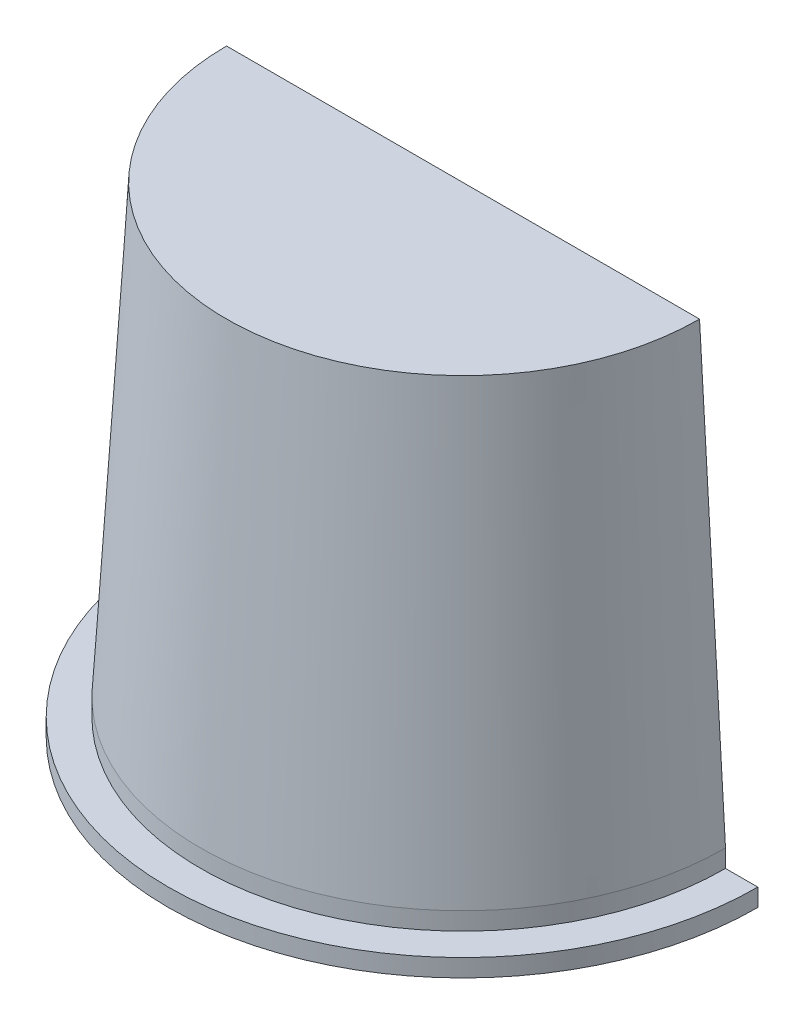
ISO-10303-21;
HEADER;
FILE_DESCRIPTION(('STEP AP214'),'2;1');
FILE_NAME('part.step','',(''),(''),'','','');
FILE_SCHEMA(('AUTOMOTIVE_DESIGN { 1 0 10303 214 1 1 1 1 }'));
ENDSEC;
DATA;
#1=APPLICATION_CONTEXT('core data for automotive mechanical design processes');
#2=APPLICATION_PROTOCOL_DEFINITION('international standard','automotive_design',2000,#1);
#3=PRODUCT_CONTEXT('',#1,'mechanical');
#4=PRODUCT('Part','Part','',(#3));
#5=PRODUCT_RELATED_PRODUCT_CATEGORY('part','',(#4));
#6=PRODUCT_DEFINITION_FORMATION('','',#4);
#7=PRODUCT_DEFINITION_CONTEXT('part definition',#1,'design');
#8=PRODUCT_DEFINITION('design','',#6,#7);
#9=PRODUCT_DEFINITION_SHAPE('','',#8);
#10=(LENGTH_UNIT() NAMED_UNIT(*) SI_UNIT(.MILLI.,.METRE.));
#11=(NAMED_UNIT(*) PLANE_ANGLE_UNIT() SI_UNIT($,.RADIAN.));
#12=(NAMED_UNIT(*) SI_UNIT($,.STERADIAN.) SOLID_ANGLE_UNIT());
#13=UNCERTAINTY_MEASURE_WITH_UNIT(LENGTH_MEASURE(1.E-05),#10,'distance_accuracy_value','');
#14=(GEOMETRIC_REPRESENTATION_CONTEXT(3) GLOBAL_UNCERTAINTY_ASSIGNED_CONTEXT((#13)) GLOBAL_UNIT_ASSIGNED_CONTEXT((#10,
#11,#12)) REPRESENTATION_CONTEXT('',''));
#15=CARTESIAN_POINT('',(0.,0.,0.));
#16=DIRECTION('',(0.,0.,1.));
#17=DIRECTION('',(1.,0.,0.));
#18=AXIS2_PLACEMENT_3D('',#15,#16,#17);
#19=CARTESIAN_POINT('',(0.,58.,0.));
#20=DIRECTION('',(0.,-1.,0.));
#21=DIRECTION('',(0.,0.,-1.));
#22=AXIS2_PLACEMENT_3D('',#19,#20,#21);
#23=PLANE('',#22);
#24=DIRECTION('',(1.,0.,0.));
#25=VECTOR('',#24,1.);
#26=CARTESIAN_POINT('',(0.,58.,0.));
#27=LINE('',#26,#25);
#28=CARTESIAN_POINT('',(-40.1166666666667,57.9999999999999,0.));
#29=VERTEX_POINT('',#28);
#30=CARTESIAN_POINT('',(40.1166666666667,58.,0.));
#31=VERTEX_POINT('',#30);
#32=EDGE_CURVE('E52',#29,#31,#27,.T.);
#33=ORIENTED_EDGE('',*,*,#32,.F.);
#34=CARTESIAN_POINT('',(0.,58.,0.));
#35=DIRECTION('',(0.,-1.,0.));
#36=DIRECTION('',(0.,0.,-1.));
#37=AXIS2_PLACEMENT_3D('',#34,#35,#36);
#38=CIRCLE('',#37,40.1166666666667);
#39=EDGE_CURVE('E110',#31,#29,#38,.T.);
#40=ORIENTED_EDGE('',*,*,#39,.F.);
#41=EDGE_LOOP('',(#33,#40));
#42=FACE_BOUND('',#41,.T.);
#43=ADVANCED_FACE('F35',(#42),#23,.F.);
#44=CARTESIAN_POINT('',(0.,58.,0.));
#45=DIRECTION('',(0.,-1.,0.));
#46=DIRECTION('',(0.,0.,-1.));
#47=AXIS2_PLACEMENT_3D('',#44,#45,#46);
#48=CONICAL_SURFACE('',#47,40.1166666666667,0.0582673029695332);
#49=DIRECTION('',(0.0582343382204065,-0.998302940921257,0.));
#50=VECTOR('',#49,1.);
#51=CARTESIAN_POINT('',(0.,745.714285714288,0.));
#52=LINE('',#51,#50);
#53=CARTESIAN_POINT('',(44.5209139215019,-17.5013815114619,0.));
#54=VERTEX_POINT('',#53);
#55=EDGE_CURVE('E11',#31,#54,#52,.T.);
#56=ORIENTED_EDGE('',*,*,#55,.F.);
#57=ORIENTED_EDGE('',*,*,#39,.T.);
#58=DIRECTION('',(0.0582343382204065,0.998302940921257,0.));
#59=VECTOR('',#58,1.);
#60=CARTESIAN_POINT('',(0.,745.714285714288,0.));
#61=LINE('',#60,#59);
#62=CARTESIAN_POINT('',(-44.5209139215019,-17.5013815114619,0.));
#63=VERTEX_POINT('',#62);
#64=EDGE_CURVE('E42',#63,#29,#61,.T.);
#65=ORIENTED_EDGE('',*,*,#64,.F.);
#66=CARTESIAN_POINT('',(0.,-17.5013815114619,0.));
#67=DIRECTION('',(0.,-1.,0.));
#68=DIRECTION('',(0.,0.,-1.));
#69=AXIS2_PLACEMENT_3D('',#66,#67,#68);
#70=CIRCLE('',#69,44.5209139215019);
#71=EDGE_CURVE('E113',#54,#63,#70,.T.);
#72=ORIENTED_EDGE('',*,*,#71,.F.);
#73=EDGE_LOOP('',(#56,#57,#65,#72));
#74=FACE_BOUND('',#73,.T.);
#75=ADVANCED_FACE('F118',(#74),#48,.T.);
#76=CARTESIAN_POINT('',(0.,0.,0.));
#77=DIRECTION('',(0.,0.,-1.));
#78=DIRECTION('',(-1.,0.,0.));
#79=AXIS2_PLACEMENT_3D('',#76,#77,#78);
#80=PLANE('',#79);
#81=ORIENTED_EDGE('',*,*,#55,.T.);
#82=DIRECTION('',(0.,1.,0.));
#83=VECTOR('',#82,1.);
#84=CARTESIAN_POINT('',(44.5209139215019,-20.5013815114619,0.));
#85=LINE('',#84,#83);
#86=CARTESIAN_POINT('',(44.5209139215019,-20.5013815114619,0.));
#87=VERTEX_POINT('',#86);
#88=EDGE_CURVE('E99',#87,#54,#85,.T.);
#89=ORIENTED_EDGE('',*,*,#88,.F.);
#90=DIRECTION('',(1.,0.,0.));
#91=VECTOR('',#90,1.);
#92=CARTESIAN_POINT('',(-50.,-20.5013815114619,0.));
#93=LINE('',#92,#91);
#94=CARTESIAN_POINT('',(50.,-20.5013815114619,0.));
#95=VERTEX_POINT('',#94);
#96=EDGE_CURVE('E123',#87,#95,#93,.T.);
#97=ORIENTED_EDGE('',*,*,#96,.T.);
#98=DIRECTION('',(0.,1.,0.));
#99=VECTOR('',#98,1.);
#100=CARTESIAN_POINT('',(50.,-23.5013815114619,0.));
#101=LINE('',#100,#99);
#102=CARTESIAN_POINT('',(50.,-23.5013815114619,0.));
#103=VERTEX_POINT('',#102);
#104=EDGE_CURVE('E84',#103,#95,#101,.T.);
#105=ORIENTED_EDGE('',*,*,#104,.F.);
#106=DIRECTION('',(1.,0.,0.));
#107=VECTOR('',#106,1.);
#108=CARTESIAN_POINT('',(-50.,-23.5013815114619,0.));
#109=LINE('',#108,#107);
#110=CARTESIAN_POINT('',(-50.,-23.5013815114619,0.));
#111=VERTEX_POINT('',#110);
#112=EDGE_CURVE('E76',#111,#103,#109,.T.);
#113=ORIENTED_EDGE('',*,*,#112,.F.);
#114=DIRECTION('',(0.,1.,0.));
#115=VECTOR('',#114,1.);
#116=CARTESIAN_POINT('',(-50.,-23.5013815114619,0.));
#117=LINE('',#116,#115);
#118=CARTESIAN_POINT('',(-50.,-20.5013815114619,0.));
#119=VERTEX_POINT('',#118);
#120=EDGE_CURVE('E81',#111,#119,#117,.T.);
#121=ORIENTED_EDGE('',*,*,#120,.T.);
#122=CARTESIAN_POINT('',(-44.5209139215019,-20.5013815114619,0.));
#123=VERTEX_POINT('',#122);
#124=EDGE_CURVE('E91',#119,#123,#93,.T.);
#125=ORIENTED_EDGE('',*,*,#124,.T.);
#126=DIRECTION('',(0.,1.,0.));
#127=VECTOR('',#126,1.);
#128=CARTESIAN_POINT('',(-44.5209139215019,-20.5013815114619,0.));
#129=LINE('',#128,#127);
#130=EDGE_CURVE('E106',#123,#63,#129,.T.);
#131=ORIENTED_EDGE('',*,*,#130,.T.);
#132=ORIENTED_EDGE('',*,*,#64,.T.);
#133=ORIENTED_EDGE('',*,*,#32,.T.);
#134=EDGE_LOOP('',(#81,#89,#97,#105,#113,#121,#125,#131,#132,#133));
#135=FACE_BOUND('',#134,.T.);
#136=ADVANCED_FACE('F78',(#135),#80,.T.);
#137=CARTESIAN_POINT('',(0.,-20.5013815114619,0.));
#138=DIRECTION('',(0.,1.,0.));
#139=DIRECTION('',(0.,0.,1.));
#140=AXIS2_PLACEMENT_3D('',#137,#138,#139);
#141=CYLINDRICAL_SURFACE('',#140,44.5209139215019);
#142=ORIENTED_EDGE('',*,*,#71,.T.);
#143=ORIENTED_EDGE('',*,*,#130,.F.);
#144=CARTESIAN_POINT('',(0.,-20.5013815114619,0.));
#145=DIRECTION('',(0.,-1.,0.));
#146=DIRECTION('',(0.,0.,-1.));
#147=AXIS2_PLACEMENT_3D('',#144,#145,#146);
#148=CIRCLE('',#147,44.5209139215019);
#149=EDGE_CURVE('E96',#87,#123,#148,.T.);
#150=ORIENTED_EDGE('',*,*,#149,.F.);
#151=ORIENTED_EDGE('',*,*,#88,.T.);
#152=EDGE_LOOP('',(#142,#143,#150,#151));
#153=FACE_BOUND('',#152,.T.);
#154=ADVANCED_FACE('F121',(#153),#141,.T.);
#155=CARTESIAN_POINT('',(0.,-23.5013815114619,0.));
#156=DIRECTION('',(0.,1.,0.));
#157=DIRECTION('',(0.,0.,1.));
#158=AXIS2_PLACEMENT_3D('',#155,#156,#157);
#159=CYLINDRICAL_SURFACE('',#158,50.);
#160=CARTESIAN_POINT('',(0.,-20.5013815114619,0.));
#161=DIRECTION('',(0.,-1.,0.));
#162=DIRECTION('',(0.,0.,-1.));
#163=AXIS2_PLACEMENT_3D('',#160,#161,#162);
#164=CIRCLE('',#163,50.);
#165=EDGE_CURVE('E95',#95,#119,#164,.T.);
#166=ORIENTED_EDGE('',*,*,#165,.T.);
#167=ORIENTED_EDGE('',*,*,#120,.F.);
#168=CARTESIAN_POINT('',(0.,-23.5013815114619,0.));
#169=DIRECTION('',(0.,-1.,0.));
#170=DIRECTION('',(0.,0.,-1.));
#171=AXIS2_PLACEMENT_3D('',#168,#169,#170);
#172=CIRCLE('',#171,50.);
#173=EDGE_CURVE('E87',#103,#111,#172,.T.);
#174=ORIENTED_EDGE('',*,*,#173,.F.);
#175=ORIENTED_EDGE('',*,*,#104,.T.);
#176=EDGE_LOOP('',(#166,#167,#174,#175));
#177=FACE_BOUND('',#176,.T.);
#178=ADVANCED_FACE('F93',(#177),#159,.T.);
#179=CARTESIAN_POINT('',(0.,-23.5013815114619,0.));
#180=DIRECTION('',(0.,-1.,0.));
#181=DIRECTION('',(0.,0.,-1.));
#182=AXIS2_PLACEMENT_3D('',#179,#180,#181);
#183=PLANE('',#182);
#184=ORIENTED_EDGE('',*,*,#173,.T.);
#185=ORIENTED_EDGE('',*,*,#112,.T.);
#186=EDGE_LOOP('',(#184,#185));
#187=FACE_BOUND('',#186,.T.);
#188=ADVANCED_FACE('F89',(#187),#183,.T.);
#189=CARTESIAN_POINT('',(0.,-20.5013815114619,0.));
#190=DIRECTION('',(0.,-1.,0.));
#191=DIRECTION('',(0.,0.,-1.));
#192=AXIS2_PLACEMENT_3D('',#189,#190,#191);
#193=PLANE('',#192);
#194=ORIENTED_EDGE('',*,*,#96,.F.);
#195=ORIENTED_EDGE('',*,*,#149,.T.);
#196=ORIENTED_EDGE('',*,*,#124,.F.);
#197=ORIENTED_EDGE('',*,*,#165,.F.);
#198=EDGE_LOOP('',(#194,#195,#196,#197));
#199=FACE_BOUND('',#198,.T.);
#200=ADVANCED_FACE('F125',(#199),#193,.F.);
#201=CLOSED_SHELL('',(#43,#75,#136,#154,#178,#188,#200));
#202=MANIFOLD_SOLID_BREP('B2',#201);
#203=ADVANCED_BREP_SHAPE_REPRESENTATION('',(#18,#202),#14);
#204=SHAPE_DEFINITION_REPRESENTATION(#9,#203);
ENDSEC;
END-ISO-10303-21;
